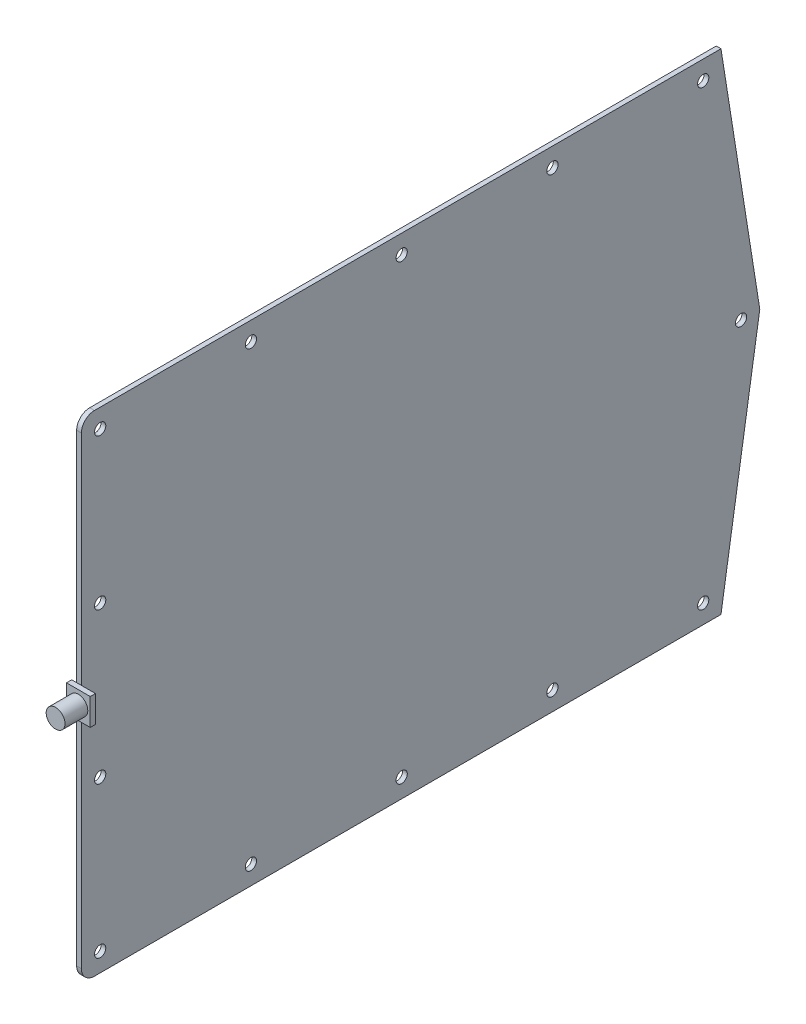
ISO-10303-21;
HEADER;
FILE_DESCRIPTION(('STEP AP214'),'2;1');
FILE_NAME('part.step','',(''),(''),'','','');
FILE_SCHEMA(('AUTOMOTIVE_DESIGN { 1 0 10303 214 1 1 1 1 }'));
ENDSEC;
DATA;
#1=APPLICATION_CONTEXT('core data for automotive mechanical design processes');
#2=APPLICATION_PROTOCOL_DEFINITION('international standard','automotive_design',2000,#1);
#3=PRODUCT_CONTEXT('',#1,'mechanical');
#4=PRODUCT('Part','Part','',(#3));
#5=PRODUCT_RELATED_PRODUCT_CATEGORY('part','',(#4));
#6=PRODUCT_DEFINITION_FORMATION('','',#4);
#7=PRODUCT_DEFINITION_CONTEXT('part definition',#1,'design');
#8=PRODUCT_DEFINITION('design','',#6,#7);
#9=PRODUCT_DEFINITION_SHAPE('','',#8);
#10=(LENGTH_UNIT() NAMED_UNIT(*) SI_UNIT(.MILLI.,.METRE.));
#11=(NAMED_UNIT(*) PLANE_ANGLE_UNIT() SI_UNIT($,.RADIAN.));
#12=(NAMED_UNIT(*) SI_UNIT($,.STERADIAN.) SOLID_ANGLE_UNIT());
#13=UNCERTAINTY_MEASURE_WITH_UNIT(LENGTH_MEASURE(1.E-05),#10,'distance_accuracy_value','');
#14=(GEOMETRIC_REPRESENTATION_CONTEXT(3) GLOBAL_UNCERTAINTY_ASSIGNED_CONTEXT((#13)) GLOBAL_UNIT_ASSIGNED_CONTEXT((#10,
#11,#12)) REPRESENTATION_CONTEXT('',''));
#15=CARTESIAN_POINT('',(0.,0.,0.));
#16=DIRECTION('',(0.,0.,1.));
#17=DIRECTION('',(1.,0.,0.));
#18=AXIS2_PLACEMENT_3D('',#15,#16,#17);
#19=CARTESIAN_POINT('',(1.6002,82.55,168.974187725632));
#20=DIRECTION('',(0.,0.,-1.));
#21=DIRECTION('',(-1.,0.,0.));
#22=AXIS2_PLACEMENT_3D('',#19,#20,#21);
#23=PLANE('',#22);
#24=DIRECTION('',(1.,0.,0.));
#25=VECTOR('',#24,1.);
#26=CARTESIAN_POINT('',(-1.6637,-4.51485,168.974187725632));
#27=LINE('',#26,#25);
#28=CARTESIAN_POINT('',(0.,-4.51485,168.974187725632));
#29=VERTEX_POINT('',#28);
#30=CARTESIAN_POINT('',(1.6002,-4.51485,168.974187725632));
#31=VERTEX_POINT('',#30);
#32=EDGE_CURVE('E391',#29,#31,#27,.T.);
#33=ORIENTED_EDGE('',*,*,#32,.F.);
#34=DIRECTION('',(0.,-1.,0.));
#35=VECTOR('',#34,1.);
#36=CARTESIAN_POINT('',(0.,82.55,168.974187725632));
#37=LINE('',#36,#35);
#38=CARTESIAN_POINT('',(0.,-78.1558,168.974187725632));
#39=VERTEX_POINT('',#38);
#40=EDGE_CURVE('E285',#29,#39,#37,.T.);
#41=ORIENTED_EDGE('',*,*,#40,.T.);
#42=DIRECTION('',(-1.,0.,0.));
#43=VECTOR('',#42,1.);
#44=CARTESIAN_POINT('',(1.6002,-78.1558,168.974187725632));
#45=LINE('',#44,#43);
#46=CARTESIAN_POINT('',(1.6002,-78.1558,168.974187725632));
#47=VERTEX_POINT('',#46);
#48=EDGE_CURVE('E341',#39,#47,#45,.F.);
#49=ORIENTED_EDGE('',*,*,#48,.T.);
#50=DIRECTION('',(0.,-1.,0.));
#51=VECTOR('',#50,1.);
#52=CARTESIAN_POINT('',(1.6002,82.55,168.974187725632));
#53=LINE('',#52,#51);
#54=EDGE_CURVE('E62',#31,#47,#53,.T.);
#55=ORIENTED_EDGE('',*,*,#54,.F.);
#56=EDGE_LOOP('',(#33,#41,#49,#55));
#57=FACE_BOUND('',#56,.T.);
#58=ADVANCED_FACE('F43',(#57),#23,.F.);
#59=DIRECTION('',(-1.,0.,0.));
#60=VECTOR('',#59,1.);
#61=CARTESIAN_POINT('',(-1.6637,4.51485,168.974187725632));
#62=LINE('',#61,#60);
#63=CARTESIAN_POINT('',(1.6002,4.51485,168.974187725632));
#64=VERTEX_POINT('',#63);
#65=CARTESIAN_POINT('',(0.,4.51485,168.974187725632));
#66=VERTEX_POINT('',#65);
#67=EDGE_CURVE('E73',#64,#66,#62,.T.);
#68=ORIENTED_EDGE('',*,*,#67,.F.);
#69=CARTESIAN_POINT('',(1.6002,78.1558,168.974187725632));
#70=VERTEX_POINT('',#69);
#71=EDGE_CURVE('E288',#70,#64,#53,.T.);
#72=ORIENTED_EDGE('',*,*,#71,.F.);
#73=DIRECTION('',(-1.,0.,0.));
#74=VECTOR('',#73,1.);
#75=CARTESIAN_POINT('',(1.6002,78.1558,168.974187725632));
#76=LINE('',#75,#74);
#77=CARTESIAN_POINT('',(0.,78.1558,168.974187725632));
#78=VERTEX_POINT('',#77);
#79=EDGE_CURVE('E337',#70,#78,#76,.T.);
#80=ORIENTED_EDGE('',*,*,#79,.T.);
#81=EDGE_CURVE('E303',#78,#66,#37,.T.);
#82=ORIENTED_EDGE('',*,*,#81,.T.);
#83=EDGE_LOOP('',(#68,#72,#80,#82));
#84=FACE_BOUND('',#83,.T.);
#85=ADVANCED_FACE('F382',(#84),#23,.F.);
#86=CARTESIAN_POINT('',(1.6002,-82.55,168.974187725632));
#87=DIRECTION('',(0.,1.,0.));
#88=DIRECTION('',(0.,0.,1.));
#89=AXIS2_PLACEMENT_3D('',#86,#87,#88);
#90=PLANE('',#89);
#91=DIRECTION('',(0.,0.,-1.));
#92=VECTOR('',#91,1.);
#93=CARTESIAN_POINT('',(1.6002,-82.55,168.974187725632));
#94=LINE('',#93,#92);
#95=CARTESIAN_POINT('',(1.6002,-82.55,164.579987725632));
#96=VERTEX_POINT('',#95);
#97=CARTESIAN_POINT('',(1.6002,-82.55,-46.5448122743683));
#98=VERTEX_POINT('',#97);
#99=EDGE_CURVE('E291',#96,#98,#94,.T.);
#100=ORIENTED_EDGE('',*,*,#99,.F.);
#101=DIRECTION('',(-1.,0.,0.));
#102=VECTOR('',#101,1.);
#103=CARTESIAN_POINT('',(1.6002,-82.55,164.579987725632));
#104=LINE('',#103,#102);
#105=CARTESIAN_POINT('',(0.,-82.55,164.579987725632));
#106=VERTEX_POINT('',#105);
#107=EDGE_CURVE('E326',#96,#106,#104,.T.);
#108=ORIENTED_EDGE('',*,*,#107,.T.);
#109=DIRECTION('',(0.,0.,-1.));
#110=VECTOR('',#109,1.);
#111=CARTESIAN_POINT('',(0.,-82.55,168.974187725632));
#112=LINE('',#111,#110);
#113=CARTESIAN_POINT('',(0.,-82.55,-46.5448122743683));
#114=VERTEX_POINT('',#113);
#115=EDGE_CURVE('E306',#106,#114,#112,.T.);
#116=ORIENTED_EDGE('',*,*,#115,.T.);
#117=DIRECTION('',(-1.,0.,0.));
#118=VECTOR('',#117,1.);
#119=CARTESIAN_POINT('',(1.6002,-82.55,-46.5448122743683));
#120=LINE('',#119,#118);
#121=EDGE_CURVE('E323',#98,#114,#120,.T.);
#122=ORIENTED_EDGE('',*,*,#121,.F.);
#123=EDGE_LOOP('',(#100,#108,#116,#122));
#124=FACE_BOUND('',#123,.T.);
#125=ADVANCED_FACE('F358',(#124),#90,.F.);
#126=CARTESIAN_POINT('',(1.6002,0.,-59.6258122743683));
#127=DIRECTION('',(0.,0.156508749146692,0.987676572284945));
#128=DIRECTION('',(0.,-0.987676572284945,0.156508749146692));
#129=AXIS2_PLACEMENT_3D('',#126,#127,#128);
#130=PLANE('',#129);
#131=DIRECTION('',(0.,0.987676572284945,-0.156508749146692));
#132=VECTOR('',#131,1.);
#133=CARTESIAN_POINT('',(0.,0.,-59.6258122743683));
#134=LINE('',#133,#132);
#135=CARTESIAN_POINT('',(0.,0.,-59.6258122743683));
#136=VERTEX_POINT('',#135);
#137=EDGE_CURVE('E310',#114,#136,#134,.T.);
#138=ORIENTED_EDGE('',*,*,#137,.T.);
#139=DIRECTION('',(-1.,0.,0.));
#140=VECTOR('',#139,1.);
#141=CARTESIAN_POINT('',(1.6002,0.,-59.6258122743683));
#142=LINE('',#141,#140);
#143=CARTESIAN_POINT('',(1.6002,0.,-59.6258122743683));
#144=VERTEX_POINT('',#143);
#145=EDGE_CURVE('E320',#144,#136,#142,.T.);
#146=ORIENTED_EDGE('',*,*,#145,.F.);
#147=DIRECTION('',(0.,0.987676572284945,-0.156508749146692));
#148=VECTOR('',#147,1.);
#149=CARTESIAN_POINT('',(1.6002,0.,-59.6258122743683));
#150=LINE('',#149,#148);
#151=EDGE_CURVE('E294',#98,#144,#150,.T.);
#152=ORIENTED_EDGE('',*,*,#151,.F.);
#153=ORIENTED_EDGE('',*,*,#121,.T.);
#154=EDGE_LOOP('',(#138,#146,#152,#153));
#155=FACE_BOUND('',#154,.T.);
#156=ADVANCED_FACE('F367',(#155),#130,.F.);
#157=CARTESIAN_POINT('',(1.6002,82.55,-46.5448122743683));
#158=DIRECTION('',(0.,-0.156508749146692,0.987676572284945));
#159=DIRECTION('',(0.,-0.987676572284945,-0.156508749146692));
#160=AXIS2_PLACEMENT_3D('',#157,#158,#159);
#161=PLANE('',#160);
#162=DIRECTION('',(0.,0.987676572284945,0.156508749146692));
#163=VECTOR('',#162,1.);
#164=CARTESIAN_POINT('',(0.,82.55,-46.5448122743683));
#165=LINE('',#164,#163);
#166=CARTESIAN_POINT('',(0.,82.55,-46.5448122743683));
#167=VERTEX_POINT('',#166);
#168=EDGE_CURVE('E312',#136,#167,#165,.T.);
#169=ORIENTED_EDGE('',*,*,#168,.T.);
#170=DIRECTION('',(-1.,0.,0.));
#171=VECTOR('',#170,1.);
#172=CARTESIAN_POINT('',(1.6002,82.55,-46.5448122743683));
#173=LINE('',#172,#171);
#174=CARTESIAN_POINT('',(1.6002,82.55,-46.5448122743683));
#175=VERTEX_POINT('',#174);
#176=EDGE_CURVE('E302',#175,#167,#173,.T.);
#177=ORIENTED_EDGE('',*,*,#176,.F.);
#178=DIRECTION('',(0.,0.987676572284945,0.156508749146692));
#179=VECTOR('',#178,1.);
#180=CARTESIAN_POINT('',(1.6002,82.55,-46.5448122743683));
#181=LINE('',#180,#179);
#182=EDGE_CURVE('E296',#144,#175,#181,.T.);
#183=ORIENTED_EDGE('',*,*,#182,.F.);
#184=ORIENTED_EDGE('',*,*,#145,.T.);
#185=EDGE_LOOP('',(#169,#177,#183,#184));
#186=FACE_BOUND('',#185,.T.);
#187=ADVANCED_FACE('F374',(#186),#161,.F.);
#188=CARTESIAN_POINT('',(1.6002,82.55,168.974187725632));
#189=DIRECTION('',(0.,-1.,0.));
#190=DIRECTION('',(0.,0.,-1.));
#191=AXIS2_PLACEMENT_3D('',#188,#189,#190);
#192=PLANE('',#191);
#193=DIRECTION('',(0.,0.,1.));
#194=VECTOR('',#193,1.);
#195=CARTESIAN_POINT('',(0.,82.55,168.974187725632));
#196=LINE('',#195,#194);
#197=CARTESIAN_POINT('',(0.,82.55,164.579987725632));
#198=VERTEX_POINT('',#197);
#199=EDGE_CURVE('E314',#167,#198,#196,.T.);
#200=ORIENTED_EDGE('',*,*,#199,.T.);
#201=DIRECTION('',(-1.,0.,0.));
#202=VECTOR('',#201,1.);
#203=CARTESIAN_POINT('',(1.6002,82.55,164.579987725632));
#204=LINE('',#203,#202);
#205=CARTESIAN_POINT('',(1.6002,82.55,164.579987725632));
#206=VERTEX_POINT('',#205);
#207=EDGE_CURVE('E12',#198,#206,#204,.F.);
#208=ORIENTED_EDGE('',*,*,#207,.T.);
#209=DIRECTION('',(0.,0.,1.));
#210=VECTOR('',#209,1.);
#211=CARTESIAN_POINT('',(1.6002,82.55,168.974187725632));
#212=LINE('',#211,#210);
#213=EDGE_CURVE('E298',#175,#206,#212,.T.);
#214=ORIENTED_EDGE('',*,*,#213,.F.);
#215=ORIENTED_EDGE('',*,*,#176,.T.);
#216=EDGE_LOOP('',(#200,#208,#214,#215));
#217=FACE_BOUND('',#216,.T.);
#218=ADVANCED_FACE('F377',(#217),#192,.F.);
#219=CARTESIAN_POINT('',(1.6002,0.,0.));
#220=DIRECTION('',(1.,0.,0.));
#221=DIRECTION('',(0.,0.,-1.));
#222=AXIS2_PLACEMENT_3D('',#219,#220,#221);
#223=PLANE('',#222);
#224=CARTESIAN_POINT('',(1.6002,0.,-53.3012122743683));
#225=DIRECTION('',(1.,0.,0.));
#226=DIRECTION('',(0.,0.,-1.));
#227=AXIS2_PLACEMENT_3D('',#224,#225,#226);
#228=CIRCLE('',#227,1.8923);
#229=CARTESIAN_POINT('',(1.6002,0.,-55.1935122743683));
#230=VERTEX_POINT('',#229);
#231=EDGE_CURVE('E195',#230,#230,#228,.T.);
#232=ORIENTED_EDGE('',*,*,#231,.F.);
#233=EDGE_LOOP('',(#232));
#234=FACE_BOUND('',#233,.T.);
#235=CARTESIAN_POINT('',(1.6002,76.2,-40.5504122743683));
#236=DIRECTION('',(1.,0.,0.));
#237=DIRECTION('',(0.,0.,-1.));
#238=AXIS2_PLACEMENT_3D('',#235,#236,#237);
#239=CIRCLE('',#238,1.89230000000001);
#240=CARTESIAN_POINT('',(1.6002,76.2,-42.4427122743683));
#241=VERTEX_POINT('',#240);
#242=EDGE_CURVE('E232',#241,#241,#239,.T.);
#243=ORIENTED_EDGE('',*,*,#242,.F.);
#244=EDGE_LOOP('',(#243));
#245=FACE_BOUND('',#244,.T.);
#246=CARTESIAN_POINT('',(1.6002,76.1999999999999,10.2495877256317));
#247=DIRECTION('',(1.,0.,0.));
#248=DIRECTION('',(0.,0.,-1.));
#249=AXIS2_PLACEMENT_3D('',#246,#247,#248);
#250=CIRCLE('',#249,1.89230000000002);
#251=CARTESIAN_POINT('',(1.6002,76.1999999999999,8.3572877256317));
#252=VERTEX_POINT('',#251);
#253=EDGE_CURVE('E226',#252,#252,#250,.T.);
#254=ORIENTED_EDGE('',*,*,#253,.F.);
#255=EDGE_LOOP('',(#254));
#256=FACE_BOUND('',#255,.T.);
#257=CARTESIAN_POINT('',(1.6002,76.1999999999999,61.0495877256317));
#258=DIRECTION('',(1.,0.,0.));
#259=DIRECTION('',(0.,0.,-1.));
#260=AXIS2_PLACEMENT_3D('',#257,#258,#259);
#261=CIRCLE('',#260,1.89230000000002);
#262=CARTESIAN_POINT('',(1.6002,76.1999999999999,59.1572877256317));
#263=VERTEX_POINT('',#262);
#264=EDGE_CURVE('E220',#263,#263,#261,.T.);
#265=ORIENTED_EDGE('',*,*,#264,.F.);
#266=EDGE_LOOP('',(#265));
#267=FACE_BOUND('',#266,.T.);
#268=CARTESIAN_POINT('',(1.6002,76.1999999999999,111.849587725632));
#269=DIRECTION('',(1.,0.,0.));
#270=DIRECTION('',(0.,0.,-1.));
#271=AXIS2_PLACEMENT_3D('',#268,#269,#270);
#272=CIRCLE('',#271,1.89230000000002);
#273=CARTESIAN_POINT('',(1.6002,76.1999999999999,109.957287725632));
#274=VERTEX_POINT('',#273);
#275=EDGE_CURVE('E214',#274,#274,#272,.T.);
#276=ORIENTED_EDGE('',*,*,#275,.F.);
#277=EDGE_LOOP('',(#276));
#278=FACE_BOUND('',#277,.T.);
#279=CARTESIAN_POINT('',(1.6002,76.2,162.649587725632));
#280=DIRECTION('',(1.,0.,0.));
#281=DIRECTION('',(0.,0.,-1.));
#282=AXIS2_PLACEMENT_3D('',#279,#280,#281);
#283=CIRCLE('',#282,1.89230000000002);
#284=CARTESIAN_POINT('',(1.6002,76.2,160.757287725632));
#285=VERTEX_POINT('',#284);
#286=EDGE_CURVE('E207',#285,#285,#283,.T.);
#287=ORIENTED_EDGE('',*,*,#286,.F.);
#288=EDGE_LOOP('',(#287));
#289=FACE_BOUND('',#288,.T.);
#290=CARTESIAN_POINT('',(1.6002,25.4,162.649587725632));
#291=DIRECTION('',(1.,0.,0.));
#292=DIRECTION('',(0.,0.,-1.));
#293=AXIS2_PLACEMENT_3D('',#290,#291,#292);
#294=CIRCLE('',#293,1.89230000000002);
#295=CARTESIAN_POINT('',(1.6002,25.4,160.757287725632));
#296=VERTEX_POINT('',#295);
#297=EDGE_CURVE('E206',#296,#296,#294,.T.);
#298=ORIENTED_EDGE('',*,*,#297,.F.);
#299=EDGE_LOOP('',(#298));
#300=FACE_BOUND('',#299,.T.);
#301=CARTESIAN_POINT('',(1.6002,-25.4,162.649587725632));
#302=DIRECTION('',(1.,0.,0.));
#303=DIRECTION('',(0.,0.,-1.));
#304=AXIS2_PLACEMENT_3D('',#301,#302,#303);
#305=CIRCLE('',#304,1.89230000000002);
#306=CARTESIAN_POINT('',(1.6002,-25.4,160.757287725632));
#307=VERTEX_POINT('',#306);
#308=EDGE_CURVE('E271',#307,#307,#305,.T.);
#309=ORIENTED_EDGE('',*,*,#308,.F.);
#310=EDGE_LOOP('',(#309));
#311=FACE_BOUND('',#310,.T.);
#312=CARTESIAN_POINT('',(1.6002,-76.2,162.649587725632));
#313=DIRECTION('',(1.,0.,0.));
#314=DIRECTION('',(0.,0.,-1.));
#315=AXIS2_PLACEMENT_3D('',#312,#313,#314);
#316=CIRCLE('',#315,1.89230000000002);
#317=CARTESIAN_POINT('',(1.6002,-76.2,160.757287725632));
#318=VERTEX_POINT('',#317);
#319=EDGE_CURVE('E263',#318,#318,#316,.T.);
#320=ORIENTED_EDGE('',*,*,#319,.F.);
#321=EDGE_LOOP('',(#320));
#322=FACE_BOUND('',#321,.T.);
#323=CARTESIAN_POINT('',(1.6002,-76.2,111.849587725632));
#324=DIRECTION('',(1.,0.,0.));
#325=DIRECTION('',(0.,0.,-1.));
#326=AXIS2_PLACEMENT_3D('',#323,#324,#325);
#327=CIRCLE('',#326,1.89230000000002);
#328=CARTESIAN_POINT('',(1.6002,-76.2,109.957287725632));
#329=VERTEX_POINT('',#328);
#330=EDGE_CURVE('E256',#329,#329,#327,.T.);
#331=ORIENTED_EDGE('',*,*,#330,.F.);
#332=EDGE_LOOP('',(#331));
#333=FACE_BOUND('',#332,.T.);
#334=CARTESIAN_POINT('',(1.6002,-76.2,61.0495877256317));
#335=DIRECTION('',(1.,0.,0.));
#336=DIRECTION('',(0.,0.,-1.));
#337=AXIS2_PLACEMENT_3D('',#334,#335,#336);
#338=CIRCLE('',#337,1.89230000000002);
#339=CARTESIAN_POINT('',(1.6002,-76.2,59.1572877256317));
#340=VERTEX_POINT('',#339);
#341=EDGE_CURVE('E250',#340,#340,#338,.T.);
#342=ORIENTED_EDGE('',*,*,#341,.F.);
#343=EDGE_LOOP('',(#342));
#344=FACE_BOUND('',#343,.T.);
#345=CARTESIAN_POINT('',(1.6002,-76.2,10.2495877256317));
#346=DIRECTION('',(1.,0.,0.));
#347=DIRECTION('',(0.,0.,-1.));
#348=AXIS2_PLACEMENT_3D('',#345,#346,#347);
#349=CIRCLE('',#348,1.89230000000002);
#350=CARTESIAN_POINT('',(1.6002,-76.2,8.35728772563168));
#351=VERTEX_POINT('',#350);
#352=EDGE_CURVE('E244',#351,#351,#349,.T.);
#353=ORIENTED_EDGE('',*,*,#352,.F.);
#354=EDGE_LOOP('',(#353));
#355=FACE_BOUND('',#354,.T.);
#356=CARTESIAN_POINT('',(1.6002,-76.2,-40.5504122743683));
#357=DIRECTION('',(1.,0.,0.));
#358=DIRECTION('',(0.,0.,-1.));
#359=AXIS2_PLACEMENT_3D('',#356,#357,#358);
#360=CIRCLE('',#359,1.89230000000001);
#361=CARTESIAN_POINT('',(1.6002,-76.2,-42.4427122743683));
#362=VERTEX_POINT('',#361);
#363=EDGE_CURVE('E243',#362,#362,#360,.T.);
#364=ORIENTED_EDGE('',*,*,#363,.F.);
#365=EDGE_LOOP('',(#364));
#366=FACE_BOUND('',#365,.T.);
#367=ORIENTED_EDGE('',*,*,#71,.T.);
#368=DIRECTION('',(0.,-1.,0.));
#369=VECTOR('',#368,1.);
#370=CARTESIAN_POINT('',(1.6002,0.,168.974187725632));
#371=LINE('',#370,#369);
#372=EDGE_CURVE('E190',#64,#31,#371,.T.);
#373=ORIENTED_EDGE('',*,*,#372,.T.);
#374=ORIENTED_EDGE('',*,*,#54,.T.);
#375=CARTESIAN_POINT('',(1.6002,-78.1558,164.579987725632));
#376=DIRECTION('',(1.,0.,0.));
#377=DIRECTION('',(0.,0.,-1.));
#378=AXIS2_PLACEMENT_3D('',#375,#376,#377);
#379=CIRCLE('',#378,4.3942);
#380=EDGE_CURVE('E52',#47,#96,#379,.T.);
#381=ORIENTED_EDGE('',*,*,#380,.T.);
#382=ORIENTED_EDGE('',*,*,#99,.T.);
#383=ORIENTED_EDGE('',*,*,#151,.T.);
#384=ORIENTED_EDGE('',*,*,#182,.T.);
#385=ORIENTED_EDGE('',*,*,#213,.T.);
#386=CARTESIAN_POINT('',(1.6002,78.1558,164.579987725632));
#387=DIRECTION('',(1.,0.,0.));
#388=DIRECTION('',(0.,0.,-1.));
#389=AXIS2_PLACEMENT_3D('',#386,#387,#388);
#390=CIRCLE('',#389,4.3942);
#391=EDGE_CURVE('E344',#206,#70,#390,.T.);
#392=ORIENTED_EDGE('',*,*,#391,.T.);
#393=EDGE_LOOP('',(#367,#373,#374,#381,#382,#383,#384,#385,#392));
#394=FACE_BOUND('',#393,.T.);
#395=ADVANCED_FACE('F352',(#234,#245,#256,#267,#278,#289,#300,#311,#322,#333,#344,#355,#366,
#394),#223,.T.);
#396=CARTESIAN_POINT('',(0.,0.,0.));
#397=DIRECTION('',(1.,0.,0.));
#398=DIRECTION('',(0.,0.,-1.));
#399=AXIS2_PLACEMENT_3D('',#396,#397,#398);
#400=PLANE('',#399);
#401=CARTESIAN_POINT('',(0.,0.,-53.3012122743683));
#402=DIRECTION('',(1.,0.,0.));
#403=DIRECTION('',(0.,0.,-1.));
#404=AXIS2_PLACEMENT_3D('',#401,#402,#403);
#405=CIRCLE('',#404,1.8923);
#406=CARTESIAN_POINT('',(0.,0.,-55.1935122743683));
#407=VERTEX_POINT('',#406);
#408=EDGE_CURVE('E235',#407,#407,#405,.T.);
#409=ORIENTED_EDGE('',*,*,#408,.T.);
#410=EDGE_LOOP('',(#409));
#411=FACE_BOUND('',#410,.T.);
#412=CARTESIAN_POINT('',(0.,76.2,-40.5504122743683));
#413=DIRECTION('',(1.,0.,0.));
#414=DIRECTION('',(0.,0.,-1.));
#415=AXIS2_PLACEMENT_3D('',#412,#413,#414);
#416=CIRCLE('',#415,1.89230000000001);
#417=CARTESIAN_POINT('',(0.,76.2,-42.4427122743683));
#418=VERTEX_POINT('',#417);
#419=EDGE_CURVE('E229',#418,#418,#416,.T.);
#420=ORIENTED_EDGE('',*,*,#419,.T.);
#421=EDGE_LOOP('',(#420));
#422=FACE_BOUND('',#421,.T.);
#423=CARTESIAN_POINT('',(0.,76.1999999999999,10.2495877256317));
#424=DIRECTION('',(1.,0.,0.));
#425=DIRECTION('',(0.,0.,-1.));
#426=AXIS2_PLACEMENT_3D('',#423,#424,#425);
#427=CIRCLE('',#426,1.89230000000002);
#428=CARTESIAN_POINT('',(0.,76.1999999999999,8.3572877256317));
#429=VERTEX_POINT('',#428);
#430=EDGE_CURVE('E223',#429,#429,#427,.T.);
#431=ORIENTED_EDGE('',*,*,#430,.T.);
#432=EDGE_LOOP('',(#431));
#433=FACE_BOUND('',#432,.T.);
#434=CARTESIAN_POINT('',(0.,76.1999999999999,61.0495877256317));
#435=DIRECTION('',(1.,0.,0.));
#436=DIRECTION('',(0.,0.,-1.));
#437=AXIS2_PLACEMENT_3D('',#434,#435,#436);
#438=CIRCLE('',#437,1.89230000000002);
#439=CARTESIAN_POINT('',(0.,76.1999999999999,59.1572877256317));
#440=VERTEX_POINT('',#439);
#441=EDGE_CURVE('E217',#440,#440,#438,.T.);
#442=ORIENTED_EDGE('',*,*,#441,.T.);
#443=EDGE_LOOP('',(#442));
#444=FACE_BOUND('',#443,.T.);
#445=CARTESIAN_POINT('',(0.,76.1999999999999,111.849587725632));
#446=DIRECTION('',(1.,0.,0.));
#447=DIRECTION('',(0.,0.,-1.));
#448=AXIS2_PLACEMENT_3D('',#445,#446,#447);
#449=CIRCLE('',#448,1.89230000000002);
#450=CARTESIAN_POINT('',(0.,76.1999999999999,109.957287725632));
#451=VERTEX_POINT('',#450);
#452=EDGE_CURVE('E211',#451,#451,#449,.T.);
#453=ORIENTED_EDGE('',*,*,#452,.T.);
#454=EDGE_LOOP('',(#453));
#455=FACE_BOUND('',#454,.T.);
#456=CARTESIAN_POINT('',(0.,76.2,162.649587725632));
#457=DIRECTION('',(1.,0.,0.));
#458=DIRECTION('',(0.,0.,-1.));
#459=AXIS2_PLACEMENT_3D('',#456,#457,#458);
#460=CIRCLE('',#459,1.89230000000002);
#461=CARTESIAN_POINT('',(0.,76.2,160.757287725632));
#462=VERTEX_POINT('',#461);
#463=EDGE_CURVE('E202',#462,#462,#460,.T.);
#464=ORIENTED_EDGE('',*,*,#463,.T.);
#465=EDGE_LOOP('',(#464));
#466=FACE_BOUND('',#465,.T.);
#467=CARTESIAN_POINT('',(0.,25.4,162.649587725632));
#468=DIRECTION('',(1.,0.,0.));
#469=DIRECTION('',(0.,0.,-1.));
#470=AXIS2_PLACEMENT_3D('',#467,#468,#469);
#471=CIRCLE('',#470,1.89230000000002);
#472=CARTESIAN_POINT('',(0.,25.4,160.757287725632));
#473=VERTEX_POINT('',#472);
#474=EDGE_CURVE('E275',#473,#473,#471,.T.);
#475=ORIENTED_EDGE('',*,*,#474,.T.);
#476=EDGE_LOOP('',(#475));
#477=FACE_BOUND('',#476,.T.);
#478=CARTESIAN_POINT('',(0.,-25.4,162.649587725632));
#479=DIRECTION('',(1.,0.,0.));
#480=DIRECTION('',(0.,0.,-1.));
#481=AXIS2_PLACEMENT_3D('',#478,#479,#480);
#482=CIRCLE('',#481,1.89230000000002);
#483=CARTESIAN_POINT('',(0.,-25.4,160.757287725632));
#484=VERTEX_POINT('',#483);
#485=EDGE_CURVE('E267',#484,#484,#482,.T.);
#486=ORIENTED_EDGE('',*,*,#485,.T.);
#487=EDGE_LOOP('',(#486));
#488=FACE_BOUND('',#487,.T.);
#489=CARTESIAN_POINT('',(0.,-76.2,162.649587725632));
#490=DIRECTION('',(1.,0.,0.));
#491=DIRECTION('',(0.,0.,-1.));
#492=AXIS2_PLACEMENT_3D('',#489,#490,#491);
#493=CIRCLE('',#492,1.89230000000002);
#494=CARTESIAN_POINT('',(0.,-76.2,160.757287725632));
#495=VERTEX_POINT('',#494);
#496=EDGE_CURVE('E259',#495,#495,#493,.T.);
#497=ORIENTED_EDGE('',*,*,#496,.T.);
#498=EDGE_LOOP('',(#497));
#499=FACE_BOUND('',#498,.T.);
#500=CARTESIAN_POINT('',(0.,-76.2,111.849587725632));
#501=DIRECTION('',(1.,0.,0.));
#502=DIRECTION('',(0.,0.,-1.));
#503=AXIS2_PLACEMENT_3D('',#500,#501,#502);
#504=CIRCLE('',#503,1.89230000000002);
#505=CARTESIAN_POINT('',(0.,-76.2,109.957287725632));
#506=VERTEX_POINT('',#505);
#507=EDGE_CURVE('E253',#506,#506,#504,.T.);
#508=ORIENTED_EDGE('',*,*,#507,.T.);
#509=EDGE_LOOP('',(#508));
#510=FACE_BOUND('',#509,.T.);
#511=CARTESIAN_POINT('',(0.,-76.2,61.0495877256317));
#512=DIRECTION('',(1.,0.,0.));
#513=DIRECTION('',(0.,0.,-1.));
#514=AXIS2_PLACEMENT_3D('',#511,#512,#513);
#515=CIRCLE('',#514,1.89230000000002);
#516=CARTESIAN_POINT('',(0.,-76.2,59.1572877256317));
#517=VERTEX_POINT('',#516);
#518=EDGE_CURVE('E247',#517,#517,#515,.T.);
#519=ORIENTED_EDGE('',*,*,#518,.T.);
#520=EDGE_LOOP('',(#519));
#521=FACE_BOUND('',#520,.T.);
#522=CARTESIAN_POINT('',(0.,-76.2,10.2495877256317));
#523=DIRECTION('',(1.,0.,0.));
#524=DIRECTION('',(0.,0.,-1.));
#525=AXIS2_PLACEMENT_3D('',#522,#523,#524);
#526=CIRCLE('',#525,1.89230000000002);
#527=CARTESIAN_POINT('',(0.,-76.2,8.35728772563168));
#528=VERTEX_POINT('',#527);
#529=EDGE_CURVE('E240',#528,#528,#526,.T.);
#530=ORIENTED_EDGE('',*,*,#529,.T.);
#531=EDGE_LOOP('',(#530));
#532=FACE_BOUND('',#531,.T.);
#533=CARTESIAN_POINT('',(0.,-76.2,-40.5504122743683));
#534=DIRECTION('',(1.,0.,0.));
#535=DIRECTION('',(0.,0.,-1.));
#536=AXIS2_PLACEMENT_3D('',#533,#534,#535);
#537=CIRCLE('',#536,1.89230000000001);
#538=CARTESIAN_POINT('',(0.,-76.2,-42.4427122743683));
#539=VERTEX_POINT('',#538);
#540=EDGE_CURVE('E282',#539,#539,#537,.T.);
#541=ORIENTED_EDGE('',*,*,#540,.T.);
#542=EDGE_LOOP('',(#541));
#543=FACE_BOUND('',#542,.T.);
#544=ORIENTED_EDGE('',*,*,#115,.F.);
#545=CARTESIAN_POINT('',(0.,-78.1558,164.579987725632));
#546=DIRECTION('',(1.,0.,0.));
#547=DIRECTION('',(0.,0.,-1.));
#548=AXIS2_PLACEMENT_3D('',#545,#546,#547);
#549=CIRCLE('',#548,4.3942);
#550=EDGE_CURVE('E333',#106,#39,#549,.F.);
#551=ORIENTED_EDGE('',*,*,#550,.T.);
#552=ORIENTED_EDGE('',*,*,#40,.F.);
#553=EDGE_CURVE('E307',#66,#29,#37,.T.);
#554=ORIENTED_EDGE('',*,*,#553,.F.);
#555=ORIENTED_EDGE('',*,*,#81,.F.);
#556=CARTESIAN_POINT('',(0.,78.1558,164.579987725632));
#557=DIRECTION('',(1.,0.,0.));
#558=DIRECTION('',(0.,0.,-1.));
#559=AXIS2_PLACEMENT_3D('',#556,#557,#558);
#560=CIRCLE('',#559,4.3942);
#561=EDGE_CURVE('E330',#78,#198,#560,.F.);
#562=ORIENTED_EDGE('',*,*,#561,.T.);
#563=ORIENTED_EDGE('',*,*,#199,.F.);
#564=ORIENTED_EDGE('',*,*,#168,.F.);
#565=ORIENTED_EDGE('',*,*,#137,.F.);
#566=EDGE_LOOP('',(#544,#551,#552,#554,#555,#562,#563,#564,#565));
#567=FACE_BOUND('',#566,.T.);
#568=ADVANCED_FACE('F363',(#411,#422,#433,#444,#455,#466,#477,#488,#499,#510,#521,#532,#543,
#567),#400,.F.);
#569=CARTESIAN_POINT('',(1.6002,-78.1558,164.579987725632));
#570=DIRECTION('',(-1.,0.,0.));
#571=DIRECTION('',(0.,0.,1.));
#572=AXIS2_PLACEMENT_3D('',#569,#570,#571);
#573=CYLINDRICAL_SURFACE('',#572,4.3942);
#574=ORIENTED_EDGE('',*,*,#380,.F.);
#575=ORIENTED_EDGE('',*,*,#48,.F.);
#576=ORIENTED_EDGE('',*,*,#550,.F.);
#577=ORIENTED_EDGE('',*,*,#107,.F.);
#578=EDGE_LOOP('',(#574,#575,#576,#577));
#579=FACE_BOUND('',#578,.T.);
#580=ADVANCED_FACE('F361',(#579),#573,.T.);
#581=CARTESIAN_POINT('',(1.6002,78.1558,164.579987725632));
#582=DIRECTION('',(-1.,0.,0.));
#583=DIRECTION('',(0.,0.,1.));
#584=AXIS2_PLACEMENT_3D('',#581,#582,#583);
#585=CYLINDRICAL_SURFACE('',#584,4.3942);
#586=ORIENTED_EDGE('',*,*,#391,.F.);
#587=ORIENTED_EDGE('',*,*,#207,.F.);
#588=ORIENTED_EDGE('',*,*,#561,.F.);
#589=ORIENTED_EDGE('',*,*,#79,.F.);
#590=EDGE_LOOP('',(#586,#587,#588,#589));
#591=FACE_BOUND('',#590,.T.);
#592=ADVANCED_FACE('F45',(#591),#585,.T.);
#593=CARTESIAN_POINT('',(0.,-76.2,-40.5504122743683));
#594=DIRECTION('',(1.,0.,0.));
#595=DIRECTION('',(0.,0.,-1.));
#596=AXIS2_PLACEMENT_3D('',#593,#594,#595);
#597=CYLINDRICAL_SURFACE('',#596,1.89230000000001);
#598=ORIENTED_EDGE('',*,*,#540,.F.);
#599=EDGE_LOOP('',(#598));
#600=FACE_BOUND('',#599,.T.);
#601=ORIENTED_EDGE('',*,*,#363,.T.);
#602=EDGE_LOOP('',(#601));
#603=FACE_BOUND('',#602,.T.);
#604=ADVANCED_FACE('F462',(#600,#603),#597,.F.);
#605=CARTESIAN_POINT('',(0.,-76.2,10.2495877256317));
#606=DIRECTION('',(1.,0.,0.));
#607=DIRECTION('',(0.,0.,-1.));
#608=AXIS2_PLACEMENT_3D('',#605,#606,#607);
#609=CYLINDRICAL_SURFACE('',#608,1.89230000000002);
#610=ORIENTED_EDGE('',*,*,#529,.F.);
#611=EDGE_LOOP('',(#610));
#612=FACE_BOUND('',#611,.T.);
#613=ORIENTED_EDGE('',*,*,#352,.T.);
#614=EDGE_LOOP('',(#613));
#615=FACE_BOUND('',#614,.T.);
#616=ADVANCED_FACE('F595',(#612,#615),#609,.F.);
#617=CARTESIAN_POINT('',(0.,-76.2,61.0495877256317));
#618=DIRECTION('',(1.,0.,0.));
#619=DIRECTION('',(0.,0.,-1.));
#620=AXIS2_PLACEMENT_3D('',#617,#618,#619);
#621=CYLINDRICAL_SURFACE('',#620,1.89230000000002);
#622=ORIENTED_EDGE('',*,*,#518,.F.);
#623=EDGE_LOOP('',(#622));
#624=FACE_BOUND('',#623,.T.);
#625=ORIENTED_EDGE('',*,*,#341,.T.);
#626=EDGE_LOOP('',(#625));
#627=FACE_BOUND('',#626,.T.);
#628=ADVANCED_FACE('F598',(#624,#627),#621,.F.);
#629=CARTESIAN_POINT('',(0.,-76.2,111.849587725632));
#630=DIRECTION('',(1.,0.,0.));
#631=DIRECTION('',(0.,0.,-1.));
#632=AXIS2_PLACEMENT_3D('',#629,#630,#631);
#633=CYLINDRICAL_SURFACE('',#632,1.89230000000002);
#634=ORIENTED_EDGE('',*,*,#507,.F.);
#635=EDGE_LOOP('',(#634));
#636=FACE_BOUND('',#635,.T.);
#637=ORIENTED_EDGE('',*,*,#330,.T.);
#638=EDGE_LOOP('',(#637));
#639=FACE_BOUND('',#638,.T.);
#640=ADVANCED_FACE('F602',(#636,#639),#633,.F.);
#641=CARTESIAN_POINT('',(0.,-76.2,162.649587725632));
#642=DIRECTION('',(1.,0.,0.));
#643=DIRECTION('',(0.,0.,-1.));
#644=AXIS2_PLACEMENT_3D('',#641,#642,#643);
#645=CYLINDRICAL_SURFACE('',#644,1.89230000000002);
#646=ORIENTED_EDGE('',*,*,#496,.F.);
#647=EDGE_LOOP('',(#646));
#648=FACE_BOUND('',#647,.T.);
#649=ORIENTED_EDGE('',*,*,#319,.T.);
#650=EDGE_LOOP('',(#649));
#651=FACE_BOUND('',#650,.T.);
#652=ADVANCED_FACE('F606',(#648,#651),#645,.F.);
#653=CARTESIAN_POINT('',(0.,-25.4,162.649587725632));
#654=DIRECTION('',(1.,0.,0.));
#655=DIRECTION('',(0.,0.,-1.));
#656=AXIS2_PLACEMENT_3D('',#653,#654,#655);
#657=CYLINDRICAL_SURFACE('',#656,1.89230000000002);
#658=ORIENTED_EDGE('',*,*,#485,.F.);
#659=EDGE_LOOP('',(#658));
#660=FACE_BOUND('',#659,.T.);
#661=ORIENTED_EDGE('',*,*,#308,.T.);
#662=EDGE_LOOP('',(#661));
#663=FACE_BOUND('',#662,.T.);
#664=ADVANCED_FACE('F610',(#660,#663),#657,.F.);
#665=CARTESIAN_POINT('',(0.,25.4,162.649587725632));
#666=DIRECTION('',(1.,0.,0.));
#667=DIRECTION('',(0.,0.,-1.));
#668=AXIS2_PLACEMENT_3D('',#665,#666,#667);
#669=CYLINDRICAL_SURFACE('',#668,1.89230000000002);
#670=ORIENTED_EDGE('',*,*,#474,.F.);
#671=EDGE_LOOP('',(#670));
#672=FACE_BOUND('',#671,.T.);
#673=ORIENTED_EDGE('',*,*,#297,.T.);
#674=EDGE_LOOP('',(#673));
#675=FACE_BOUND('',#674,.T.);
#676=ADVANCED_FACE('F576',(#672,#675),#669,.F.);
#677=CARTESIAN_POINT('',(0.,76.2,162.649587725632));
#678=DIRECTION('',(1.,0.,0.));
#679=DIRECTION('',(0.,0.,-1.));
#680=AXIS2_PLACEMENT_3D('',#677,#678,#679);
#681=CYLINDRICAL_SURFACE('',#680,1.89230000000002);
#682=ORIENTED_EDGE('',*,*,#463,.F.);
#683=EDGE_LOOP('',(#682));
#684=FACE_BOUND('',#683,.T.);
#685=ORIENTED_EDGE('',*,*,#286,.T.);
#686=EDGE_LOOP('',(#685));
#687=FACE_BOUND('',#686,.T.);
#688=ADVANCED_FACE('F572',(#684,#687),#681,.F.);
#689=CARTESIAN_POINT('',(0.,76.1999999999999,111.849587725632));
#690=DIRECTION('',(1.,0.,0.));
#691=DIRECTION('',(0.,0.,-1.));
#692=AXIS2_PLACEMENT_3D('',#689,#690,#691);
#693=CYLINDRICAL_SURFACE('',#692,1.89230000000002);
#694=ORIENTED_EDGE('',*,*,#452,.F.);
#695=EDGE_LOOP('',(#694));
#696=FACE_BOUND('',#695,.T.);
#697=ORIENTED_EDGE('',*,*,#275,.T.);
#698=EDGE_LOOP('',(#697));
#699=FACE_BOUND('',#698,.T.);
#700=ADVANCED_FACE('F575',(#696,#699),#693,.F.);
#701=CARTESIAN_POINT('',(0.,76.1999999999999,61.0495877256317));
#702=DIRECTION('',(1.,0.,0.));
#703=DIRECTION('',(0.,0.,-1.));
#704=AXIS2_PLACEMENT_3D('',#701,#702,#703);
#705=CYLINDRICAL_SURFACE('',#704,1.89230000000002);
#706=ORIENTED_EDGE('',*,*,#441,.F.);
#707=EDGE_LOOP('',(#706));
#708=FACE_BOUND('',#707,.T.);
#709=ORIENTED_EDGE('',*,*,#264,.T.);
#710=EDGE_LOOP('',(#709));
#711=FACE_BOUND('',#710,.T.);
#712=ADVANCED_FACE('F580',(#708,#711),#705,.F.);
#713=CARTESIAN_POINT('',(0.,76.1999999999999,10.2495877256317));
#714=DIRECTION('',(1.,0.,0.));
#715=DIRECTION('',(0.,0.,-1.));
#716=AXIS2_PLACEMENT_3D('',#713,#714,#715);
#717=CYLINDRICAL_SURFACE('',#716,1.89230000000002);
#718=ORIENTED_EDGE('',*,*,#430,.F.);
#719=EDGE_LOOP('',(#718));
#720=FACE_BOUND('',#719,.T.);
#721=ORIENTED_EDGE('',*,*,#253,.T.);
#722=EDGE_LOOP('',(#721));
#723=FACE_BOUND('',#722,.T.);
#724=ADVANCED_FACE('F584',(#720,#723),#717,.F.);
#725=CARTESIAN_POINT('',(0.,76.2,-40.5504122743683));
#726=DIRECTION('',(1.,0.,0.));
#727=DIRECTION('',(0.,0.,-1.));
#728=AXIS2_PLACEMENT_3D('',#725,#726,#727);
#729=CYLINDRICAL_SURFACE('',#728,1.89230000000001);
#730=ORIENTED_EDGE('',*,*,#419,.F.);
#731=EDGE_LOOP('',(#730));
#732=FACE_BOUND('',#731,.T.);
#733=ORIENTED_EDGE('',*,*,#242,.T.);
#734=EDGE_LOOP('',(#733));
#735=FACE_BOUND('',#734,.T.);
#736=ADVANCED_FACE('F588',(#732,#735),#729,.F.);
#737=CARTESIAN_POINT('',(0.,0.,-53.3012122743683));
#738=DIRECTION('',(1.,0.,0.));
#739=DIRECTION('',(0.,0.,-1.));
#740=AXIS2_PLACEMENT_3D('',#737,#738,#739);
#741=CYLINDRICAL_SURFACE('',#740,1.8923);
#742=ORIENTED_EDGE('',*,*,#408,.F.);
#743=EDGE_LOOP('',(#742));
#744=FACE_BOUND('',#743,.T.);
#745=ORIENTED_EDGE('',*,*,#231,.T.);
#746=EDGE_LOOP('',(#745));
#747=FACE_BOUND('',#746,.T.);
#748=ADVANCED_FACE('F513',(#744,#747),#741,.F.);
#749=CARTESIAN_POINT('',(0.,0.,168.974187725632));
#750=DIRECTION('',(0.,0.,1.));
#751=DIRECTION('',(1.,0.,0.));
#752=AXIS2_PLACEMENT_3D('',#749,#750,#751);
#753=PLANE('',#752);
#754=CARTESIAN_POINT('',(-1.6637,4.51485,168.974187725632));
#755=VERTEX_POINT('',#754);
#756=EDGE_CURVE('E403',#66,#755,#62,.T.);
#757=ORIENTED_EDGE('',*,*,#756,.F.);
#758=ORIENTED_EDGE('',*,*,#553,.T.);
#759=CARTESIAN_POINT('',(-1.6637,-4.51485,168.974187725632));
#760=VERTEX_POINT('',#759);
#761=EDGE_CURVE('E393',#760,#29,#27,.T.);
#762=ORIENTED_EDGE('',*,*,#761,.F.);
#763=DIRECTION('',(0.,-1.,0.));
#764=VECTOR('',#763,1.);
#765=CARTESIAN_POINT('',(-1.6637,4.51485,168.974187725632));
#766=LINE('',#765,#764);
#767=EDGE_CURVE('E188',#755,#760,#766,.T.);
#768=ORIENTED_EDGE('',*,*,#767,.F.);
#769=EDGE_LOOP('',(#757,#758,#762,#768));
#770=FACE_BOUND('',#769,.T.);
#771=ADVANCED_FACE('F448',(#770),#753,.F.);
#772=CARTESIAN_POINT('',(-1.6637,4.51485,170.726787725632));
#773=DIRECTION('',(1.,0.,0.));
#774=DIRECTION('',(0.,0.,-1.));
#775=AXIS2_PLACEMENT_3D('',#772,#773,#774);
#776=PLANE('',#775);
#777=ORIENTED_EDGE('',*,*,#767,.T.);
#778=DIRECTION('',(0.,0.,-1.));
#779=VECTOR('',#778,1.);
#780=CARTESIAN_POINT('',(-1.6637,-4.51485,170.726787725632));
#781=LINE('',#780,#779);
#782=CARTESIAN_POINT('',(-1.6637,-4.51485,170.726787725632));
#783=VERTEX_POINT('',#782);
#784=EDGE_CURVE('E166',#783,#760,#781,.T.);
#785=ORIENTED_EDGE('',*,*,#784,.F.);
#786=DIRECTION('',(0.,-1.,0.));
#787=VECTOR('',#786,1.);
#788=CARTESIAN_POINT('',(-1.6637,4.51485,170.726787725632));
#789=LINE('',#788,#787);
#790=CARTESIAN_POINT('',(-1.6637,4.51485,170.726787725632));
#791=VERTEX_POINT('',#790);
#792=EDGE_CURVE('E174',#791,#783,#789,.T.);
#793=ORIENTED_EDGE('',*,*,#792,.F.);
#794=DIRECTION('',(0.,0.,-1.));
#795=VECTOR('',#794,1.);
#796=CARTESIAN_POINT('',(-1.6637,4.51485,170.726787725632));
#797=LINE('',#796,#795);
#798=EDGE_CURVE('E407',#791,#755,#797,.T.);
#799=ORIENTED_EDGE('',*,*,#798,.T.);
#800=EDGE_LOOP('',(#777,#785,#793,#799));
#801=FACE_BOUND('',#800,.T.);
#802=ADVANCED_FACE('F186',(#801),#776,.F.);
#803=CARTESIAN_POINT('',(-1.6637,-4.51485,170.726787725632));
#804=DIRECTION('',(0.,1.,0.));
#805=DIRECTION('',(0.,0.,1.));
#806=AXIS2_PLACEMENT_3D('',#803,#804,#805);
#807=PLANE('',#806);
#808=ORIENTED_EDGE('',*,*,#761,.T.);
#809=ORIENTED_EDGE('',*,*,#32,.T.);
#810=CARTESIAN_POINT('',(6.3246,-4.51485,168.974187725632));
#811=VERTEX_POINT('',#810);
#812=EDGE_CURVE('E394',#31,#811,#27,.T.);
#813=ORIENTED_EDGE('',*,*,#812,.T.);
#814=DIRECTION('',(0.,0.,-1.));
#815=VECTOR('',#814,1.);
#816=CARTESIAN_POINT('',(6.3246,-4.51485,170.726787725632));
#817=LINE('',#816,#815);
#818=CARTESIAN_POINT('',(6.3246,-4.51485,170.726787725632));
#819=VERTEX_POINT('',#818);
#820=EDGE_CURVE('E169',#819,#811,#817,.T.);
#821=ORIENTED_EDGE('',*,*,#820,.F.);
#822=DIRECTION('',(1.,0.,0.));
#823=VECTOR('',#822,1.);
#824=CARTESIAN_POINT('',(-1.6637,-4.51485,170.726787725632));
#825=LINE('',#824,#823);
#826=EDGE_CURVE('E161',#783,#819,#825,.T.);
#827=ORIENTED_EDGE('',*,*,#826,.F.);
#828=ORIENTED_EDGE('',*,*,#784,.T.);
#829=EDGE_LOOP('',(#808,#809,#813,#821,#827,#828));
#830=FACE_BOUND('',#829,.T.);
#831=ADVANCED_FACE('F164',(#830),#807,.F.);
#832=CARTESIAN_POINT('',(6.3246,4.51485,170.726787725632));
#833=DIRECTION('',(-1.,0.,0.));
#834=DIRECTION('',(0.,0.,1.));
#835=AXIS2_PLACEMENT_3D('',#832,#833,#834);
#836=PLANE('',#835);
#837=DIRECTION('',(0.,1.,0.));
#838=VECTOR('',#837,1.);
#839=CARTESIAN_POINT('',(6.3246,4.51485,168.974187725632));
#840=LINE('',#839,#838);
#841=CARTESIAN_POINT('',(6.3246,4.51485,168.974187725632));
#842=VERTEX_POINT('',#841);
#843=EDGE_CURVE('E396',#811,#842,#840,.T.);
#844=ORIENTED_EDGE('',*,*,#843,.T.);
#845=DIRECTION('',(0.,0.,-1.));
#846=VECTOR('',#845,1.);
#847=CARTESIAN_POINT('',(6.3246,4.51485,170.726787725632));
#848=LINE('',#847,#846);
#849=CARTESIAN_POINT('',(6.3246,4.51485,170.726787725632));
#850=VERTEX_POINT('',#849);
#851=EDGE_CURVE('E198',#850,#842,#848,.T.);
#852=ORIENTED_EDGE('',*,*,#851,.F.);
#853=DIRECTION('',(0.,1.,0.));
#854=VECTOR('',#853,1.);
#855=CARTESIAN_POINT('',(6.3246,4.51485,170.726787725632));
#856=LINE('',#855,#854);
#857=EDGE_CURVE('E173',#819,#850,#856,.T.);
#858=ORIENTED_EDGE('',*,*,#857,.F.);
#859=ORIENTED_EDGE('',*,*,#820,.T.);
#860=EDGE_LOOP('',(#844,#852,#858,#859));
#861=FACE_BOUND('',#860,.T.);
#862=ADVANCED_FACE('F421',(#861),#836,.F.);
#863=CARTESIAN_POINT('',(-1.6637,4.51485,170.726787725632));
#864=DIRECTION('',(0.,-1.,0.));
#865=DIRECTION('',(0.,0.,-1.));
#866=AXIS2_PLACEMENT_3D('',#863,#864,#865);
#867=PLANE('',#866);
#868=EDGE_CURVE('E184',#842,#64,#62,.T.);
#869=ORIENTED_EDGE('',*,*,#868,.T.);
#870=ORIENTED_EDGE('',*,*,#67,.T.);
#871=ORIENTED_EDGE('',*,*,#756,.T.);
#872=ORIENTED_EDGE('',*,*,#798,.F.);
#873=DIRECTION('',(-1.,0.,0.));
#874=VECTOR('',#873,1.);
#875=CARTESIAN_POINT('',(-1.6637,4.51485,170.726787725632));
#876=LINE('',#875,#874);
#877=EDGE_CURVE('E179',#850,#791,#876,.T.);
#878=ORIENTED_EDGE('',*,*,#877,.F.);
#879=ORIENTED_EDGE('',*,*,#851,.T.);
#880=EDGE_LOOP('',(#869,#870,#871,#872,#878,#879));
#881=FACE_BOUND('',#880,.T.);
#882=ADVANCED_FACE('F415',(#881),#867,.F.);
#883=CARTESIAN_POINT('',(0.,0.,170.726787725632));
#884=DIRECTION('',(0.,0.,1.));
#885=DIRECTION('',(1.,0.,0.));
#886=AXIS2_PLACEMENT_3D('',#883,#884,#885);
#887=PLANE('',#886);
#888=CARTESIAN_POINT('',(2.33045,0.,170.726787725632));
#889=DIRECTION('',(0.,0.,1.));
#890=DIRECTION('',(1.,0.,0.));
#891=AXIS2_PLACEMENT_3D('',#888,#889,#890);
#892=CIRCLE('',#891,3.175);
#893=CARTESIAN_POINT('',(5.50545,0.,170.726787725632));
#894=VERTEX_POINT('',#893);
#895=EDGE_CURVE('E425',#894,#894,#892,.T.);
#896=ORIENTED_EDGE('',*,*,#895,.F.);
#897=EDGE_LOOP('',(#896));
#898=FACE_BOUND('',#897,.T.);
#899=ORIENTED_EDGE('',*,*,#792,.T.);
#900=ORIENTED_EDGE('',*,*,#826,.T.);
#901=ORIENTED_EDGE('',*,*,#857,.T.);
#902=ORIENTED_EDGE('',*,*,#877,.T.);
#903=EDGE_LOOP('',(#899,#900,#901,#902));
#904=FACE_BOUND('',#903,.T.);
#905=ADVANCED_FACE('F177',(#898,#904),#887,.T.);
#906=ORIENTED_EDGE('',*,*,#372,.F.);
#907=ORIENTED_EDGE('',*,*,#868,.F.);
#908=ORIENTED_EDGE('',*,*,#843,.F.);
#909=ORIENTED_EDGE('',*,*,#812,.F.);
#910=EDGE_LOOP('',(#906,#907,#908,#909));
#911=FACE_BOUND('',#910,.T.);
#912=ADVANCED_FACE('F419',(#911),#753,.F.);
#913=CARTESIAN_POINT('',(2.33045,0.,178.397587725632));
#914=DIRECTION('',(0.,0.,-1.));
#915=DIRECTION('',(-1.,0.,0.));
#916=AXIS2_PLACEMENT_3D('',#913,#914,#915);
#917=CYLINDRICAL_SURFACE('',#916,3.175);
#918=CARTESIAN_POINT('',(2.33045,0.,178.397587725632));
#919=DIRECTION('',(0.,0.,1.));
#920=DIRECTION('',(1.,0.,0.));
#921=AXIS2_PLACEMENT_3D('',#918,#919,#920);
#922=CIRCLE('',#921,3.175);
#923=CARTESIAN_POINT('',(5.50545,0.,178.397587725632));
#924=VERTEX_POINT('',#923);
#925=EDGE_CURVE('E429',#924,#924,#922,.T.);
#926=ORIENTED_EDGE('',*,*,#925,.F.);
#927=EDGE_LOOP('',(#926));
#928=FACE_BOUND('',#927,.T.);
#929=ORIENTED_EDGE('',*,*,#895,.T.);
#930=EDGE_LOOP('',(#929));
#931=FACE_BOUND('',#930,.T.);
#932=ADVANCED_FACE('F435',(#928,#931),#917,.T.);
#933=CARTESIAN_POINT('',(2.33045,0.,178.397587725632));
#934=DIRECTION('',(0.,0.,1.));
#935=DIRECTION('',(1.,0.,0.));
#936=AXIS2_PLACEMENT_3D('',#933,#934,#935);
#937=PLANE('',#936);
#938=ORIENTED_EDGE('',*,*,#925,.T.);
#939=EDGE_LOOP('',(#938));
#940=FACE_BOUND('',#939,.T.);
#941=ADVANCED_FACE('F433',(#940),#937,.T.);
#942=CLOSED_SHELL('',(#58,#85,#125,#156,#187,#218,#395,#568,#580,#592,#604,#616,#628,#640,#652,
#664,#676,#688,#700,#712,#724,#736,#748,#771,#802,#831,#862,#882,#905,#912,#932,#941));
#943=MANIFOLD_SOLID_BREP('B2',#942);
#944=ADVANCED_BREP_SHAPE_REPRESENTATION('',(#18,#943),#14);
#945=SHAPE_DEFINITION_REPRESENTATION(#9,#944);
ENDSEC;
END-ISO-10303-21;
